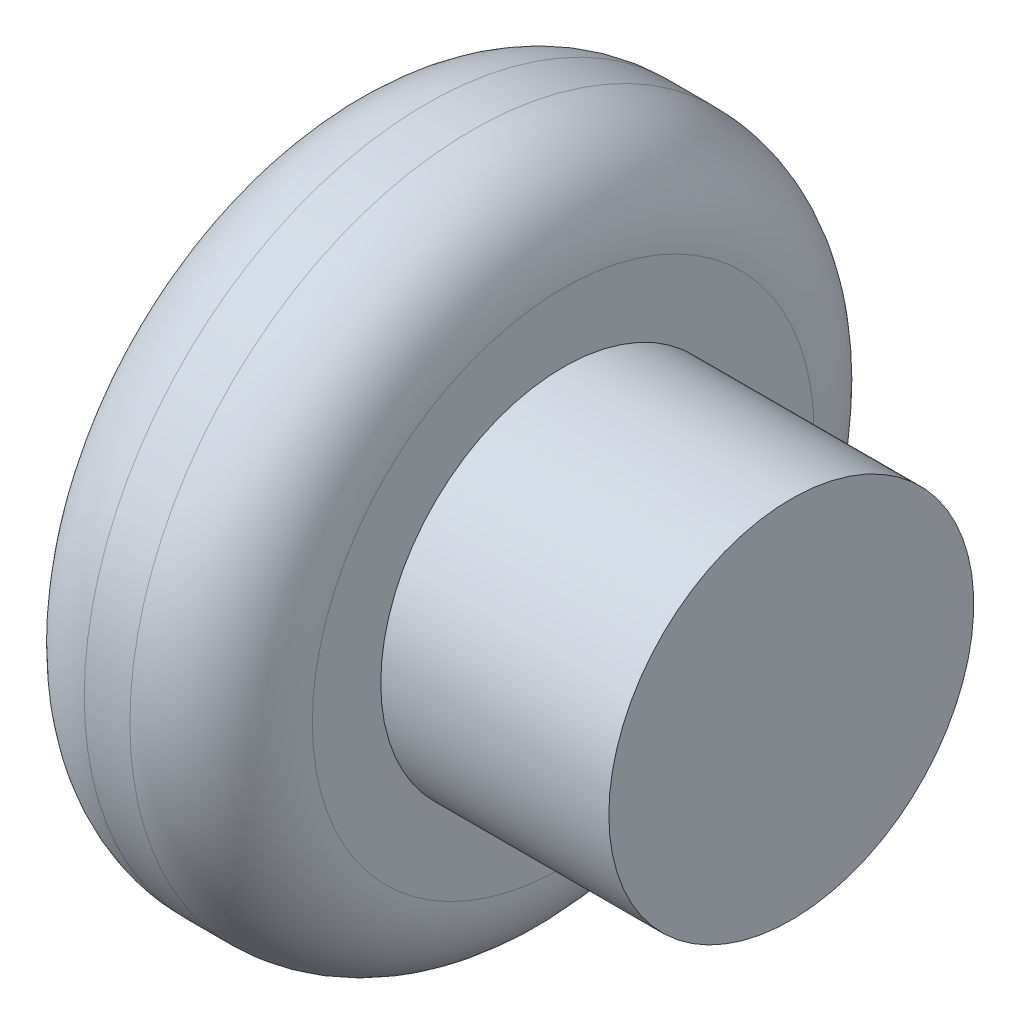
from build123d import *


with BuildPart() as part:
    # Sketch 1 → Revolve 1 (revolve)
    with BuildSketch(Plane.XY, mode=Mode.PRIVATE) as revolve_1_sk:
        with BuildLine():
            Line((0, 0), (20, 0))
            Line((20, 0), (20, 8))
            Line((20, 8), (10, 8))
            Line((10, 8), (10, 11))
            ThreePointArc((10, 11), (8.828427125, 13.828427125), (6, 15))
            Line((6, 15), (4, 15))
            ThreePointArc((4, 15), (1.171572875, 13.828427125), (0, 11))
            Line((0, 11), (0, 0))
        make_face()
    revolve(revolve_1_sk.sketch.rotate(Axis((0, 0, 0), (1, 0, 0)), 90), axis=Axis((0, 0, 0), (1, 0, 0)))


solid = part.part
